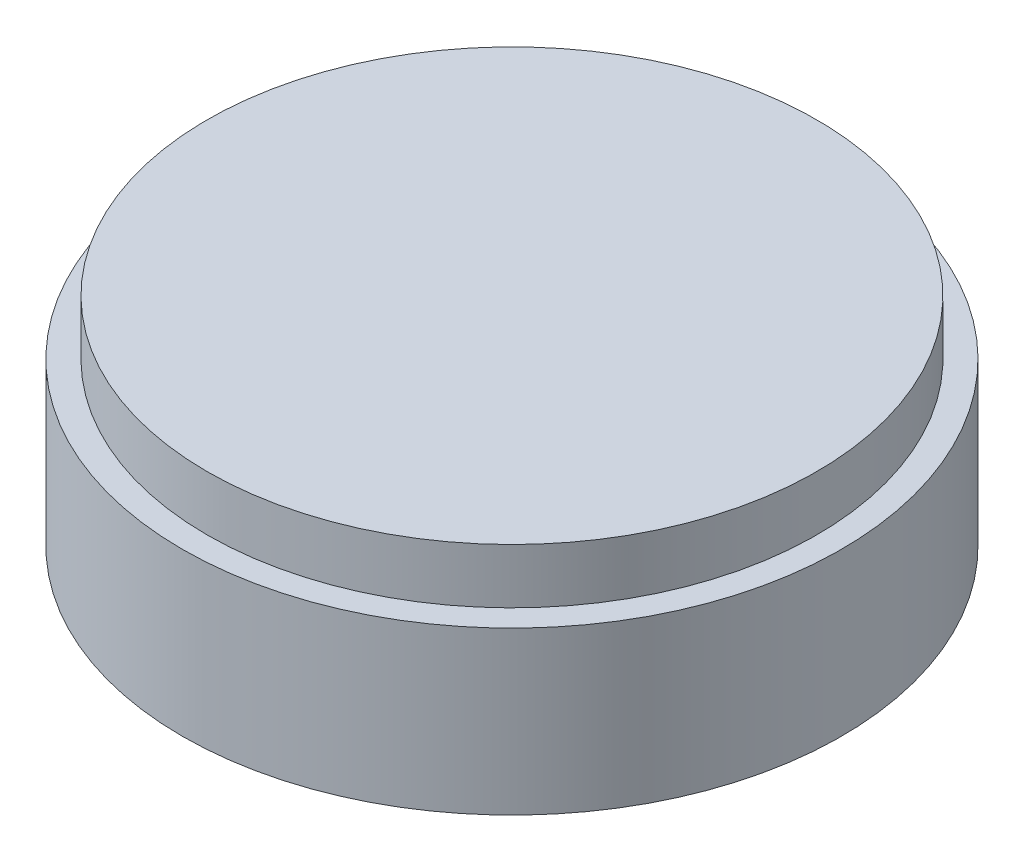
from build123d import *

# Parameters (mm, degrees)
IZIM1_R                     = 37.85
Y_KSEKLIK_EKSTR_ZYON1_DEPTH = 18.6
IZIM2_R                     = 35
Y_KSEKLIK_EKSTR_ZYON2_DEPTH = 6.3
IZIM3_R                     = 1.5
KES_EKSTR_ZYON1_DEPTH       = 6.3


with BuildPart() as part:
    # izim1 → Y_kseklik-Ekstr_zyon1 (new body)
    with BuildSketch(Plane(origin=(0, 0, 0), x_dir=(1, 0, 0), z_dir=(0, 1, 0))):
        with Locations(Location((0, 0, 0), (0, 0, 270))):
            Circle(IZIM1_R)
    extrude(amount=Y_KSEKLIK_EKSTR_ZYON1_DEPTH)

    # izim2 → Y_kseklik-Ekstr_zyon2 (add)
    with BuildSketch(Plane(origin=(0, 18.6, 0), x_dir=(1, 0, 0), z_dir=(0, 1, 0))):
        with Locations(Location((0, 0, 0), (0, 0, 270))):
            Circle(IZIM2_R)
    extrude(amount=Y_KSEKLIK_EKSTR_ZYON2_DEPTH)

    # izim3 → Kes-Ekstr_zyon1 (cut)
    with BuildSketch(Plane.XZ):
        with Locations(Location((-20.859650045, 20.859650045, 0), (0, 0, 270))):
            Circle(IZIM3_R)
        with Locations(Location((20.859650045, 20.859650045, 0), (0, 0, 270))):
            Circle(IZIM3_R)
        with Locations(Location((20.859650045, -20.859650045, 0), (0, 0, 270))):
            Circle(IZIM3_R)
        with Locations(Location((-20.859650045, -20.859650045, 0), (0, 0, 270))):
            Circle(IZIM3_R)
        with Locations(Location((0, 29.5, 0), (0, 0, 270))):
            Circle(IZIM3_R)
    extrude(amount=-KES_EKSTR_ZYON1_DEPTH, mode=Mode.SUBTRACT)


solid = part.part
